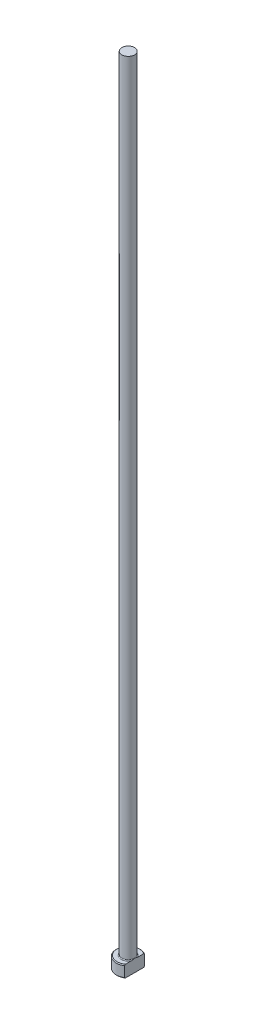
from build123d import *
from build123d.topology import SkipClean

# Parameters (mm, degrees)
CHAMFER1_SIZE = 0.2
FILLET1_R     = 0.2
KEY_DEPTH     = 201.044994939


with BuildPart() as part:
    # Sketch1 → Revolve1 (revolve)
    with BuildSketch(Plane.XY, mode=Mode.PRIVATE) as revolve1_sk:
        Polygon((0, 0), (-3, 0), (-3, 3), (-1.6, 3), (-1.6, 200), (0, 200), align=None)
    revolve(revolve1_sk.sketch.rotate(Axis((0, 259.958771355, 0), (0, -1, 0)), 270), axis=Axis((0, 259.958771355, 0), (0, -1, 0)))

    # Chamfer1
    chamfer1_edges = [part.edges().sort_by_distance(p)[0] for p in [
        (0, 3, -3),
        (0, 0, -3),
    ]]
    chamfer(chamfer1_edges, length=CHAMFER1_SIZE)

    # Fillet1
    fillet1_edges = [part.edges().sort_by_distance(p)[0] for p in [
        (0, 3, -1.6),
    ]]
    fillet(fillet1_edges, radius=FILLET1_R)

    # Sketch2 → KEY (cut, through all)
    with SkipClean():  # the faces are left unmerged after this step: merging them gives an invalid solid
        with BuildSketch(Plane(origin=(0, 0, 0), x_dir=(1, 0, 0), z_dir=(0, 1, 0))):
            with BuildLine():
                Line((1.6, 2.537715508), (1.6, -2.537715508))
                ThreePointArc((1.6, -2.537715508), (3, 0), (1.6, 2.537715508))
            make_face()
        extrude(amount=KEY_DEPTH, mode=Mode.SUBTRACT)


solid = part.part
